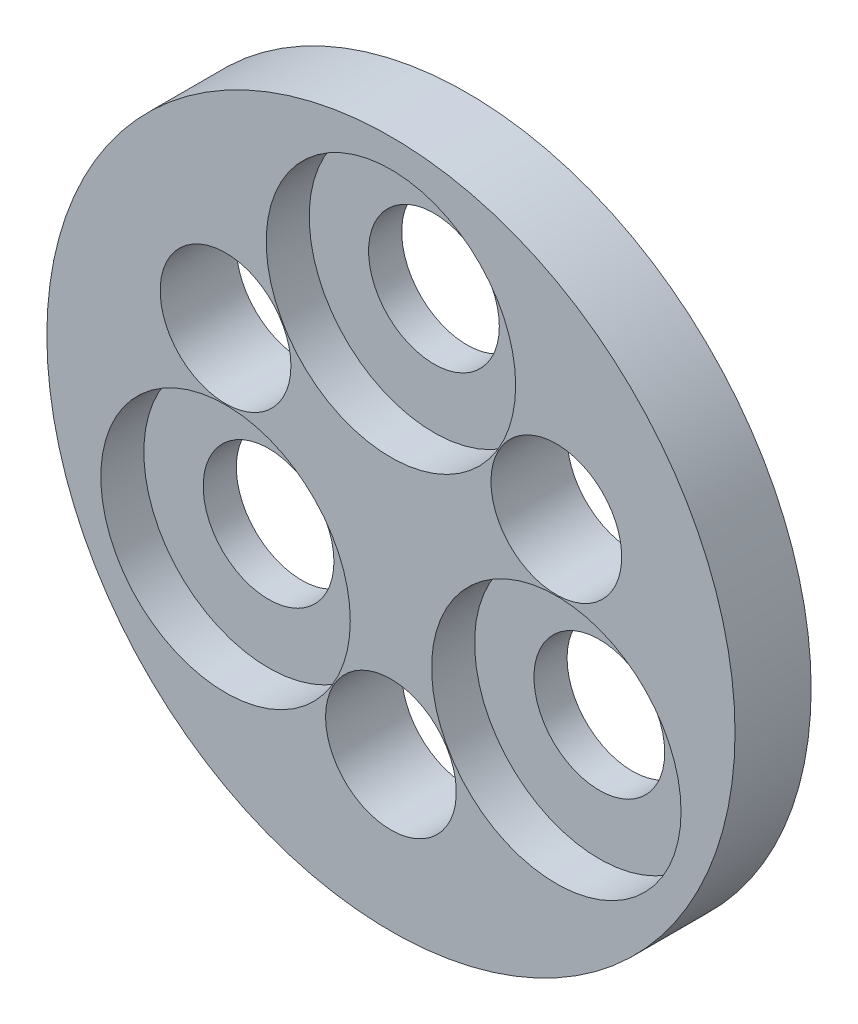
from build123d import *

# Parameters (mm, degrees)
SKETCH1_R          = 10.16
SKETCH1_R_2        = 1.9304
EXTRUDE1_DEPTH     = 2.2479
SKETCH3_R          = 3.683
CUT_EXTRUDE1_DEPTH = 1.27


with BuildPart() as part:
    # Sketch1 → Extrude1 (new body)
    with BuildSketch(Plane.XY):
        Circle(SKETCH1_R)
        with Locations((0, 5.6388)):
            Circle(SKETCH1_R_2, mode=Mode.SUBTRACT)
        with Locations(Location((0, -5.6388, 0), (0, 0, 180))):
            Circle(SKETCH1_R_2, mode=Mode.SUBTRACT)
        with Locations((-4.883344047, 2.8194)):
            Circle(SKETCH1_R_2, mode=Mode.SUBTRACT)
        with Locations((-4.883344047, -2.8194)):
            Circle(SKETCH1_R_2, mode=Mode.SUBTRACT)
        with Locations(Location((4.883344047, -2.8194, 0), (0, 0, 180))):
            Circle(SKETCH1_R_2, mode=Mode.SUBTRACT)
        with Locations(Location((4.883344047, 2.8194, 0), (0, 0, 180))):
            Circle(SKETCH1_R_2, mode=Mode.SUBTRACT)
    extrude(amount=-EXTRUDE1_DEPTH)

    # Sketch3 → Cut-Extrude1 (cut)
    with BuildSketch(Plane.XY):
        with Locations((0, 5.6388)):
            Circle(SKETCH3_R)
        with Locations((-4.883344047, -2.8194)):
            Circle(SKETCH3_R)
        with Locations((4.883344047, -2.8194)):
            Circle(SKETCH3_R)
    extrude(amount=-CUT_EXTRUDE1_DEPTH, mode=Mode.SUBTRACT)

    # Sketch5 → Cut-Revolve1 (revolve, cut)
    with BuildSketch(Plane(origin=(0, 0, 0), x_dir=(1, 0, 0), z_dir=(0, 1, 0)), mode=Mode.PRIVATE) as cut_revolve1_sk:
        with BuildLine():
            Line((0, 2.2479), (0, 0.742252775))
            ThreePointArc((0, 0.742252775), (0.018583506, 0.743303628), (0.036217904, 0.74926005))
            Line((0.036217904, 0.74926005), (2.176497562, 2.2479))
            Line((2.176497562, 2.2479), (0, 2.2479))
        make_face()
    revolve(cut_revolve1_sk.sketch.rotate(Axis((0, 0, -2.2479), (0, 0, 1)), 180), axis=Axis((0, 0, -2.2479), (0, 0, 1)), mode=Mode.SUBTRACT)


solid = part.part
